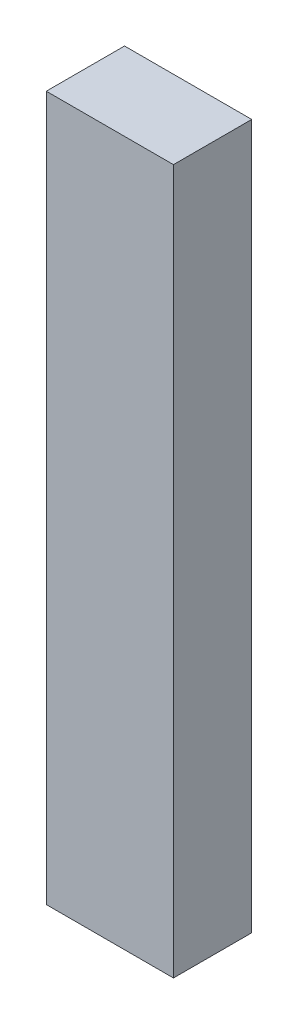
from build123d import *

# Parameters (mm, degrees)
SKETCH1_W           = 82.55
SKETCH1_H           = 50.8
BOSS_EXTRUDE1_DEPTH = 457.2


with BuildPart() as part:
    # Sketch1 → Boss-Extrude1 (new body)
    with BuildSketch(Plane(origin=(0, 0, 0), x_dir=(1, 0, 0), z_dir=(0, 1, 0))):
        Rectangle(SKETCH1_W, SKETCH1_H)
    extrude(amount=BOSS_EXTRUDE1_DEPTH)


solid = part.part
